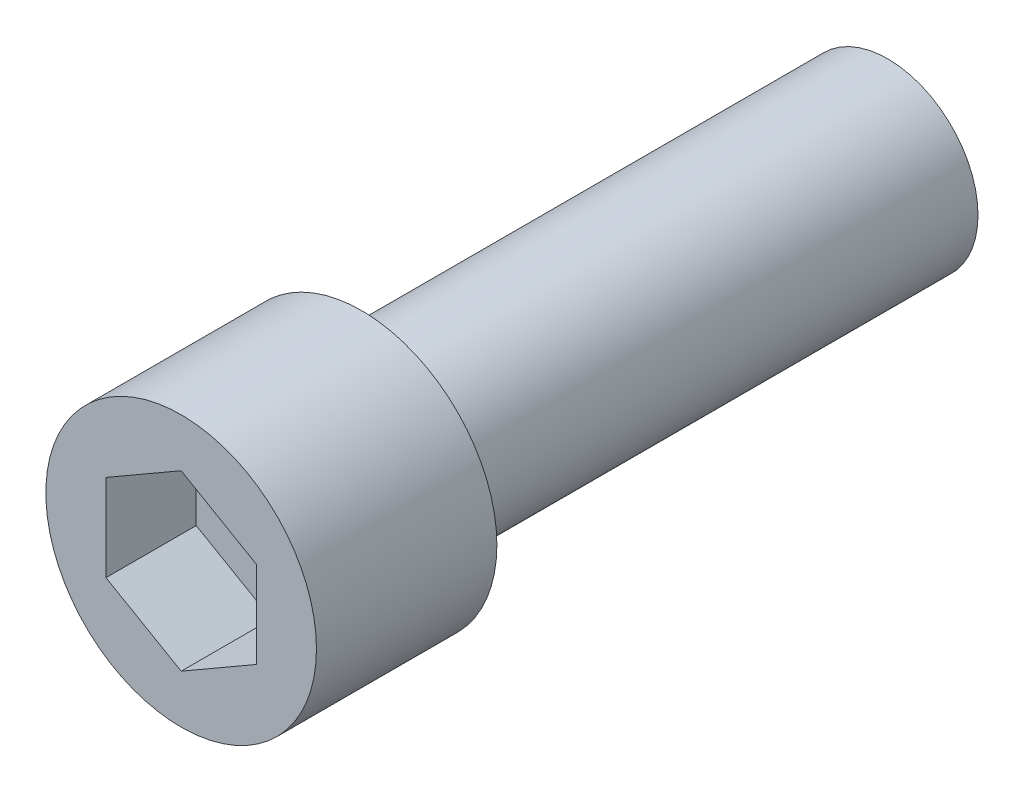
ISO-10303-21;
HEADER;
FILE_DESCRIPTION(('STEP AP214'),'2;1');
FILE_NAME('part.step','',(''),(''),'','','');
FILE_SCHEMA(('AUTOMOTIVE_DESIGN { 1 0 10303 214 1 1 1 1 }'));
ENDSEC;
DATA;
#1=APPLICATION_CONTEXT('core data for automotive mechanical design processes');
#2=APPLICATION_PROTOCOL_DEFINITION('international standard','automotive_design',2000,#1);
#3=PRODUCT_CONTEXT('',#1,'mechanical');
#4=PRODUCT('Part','Part','',(#3));
#5=PRODUCT_RELATED_PRODUCT_CATEGORY('part','',(#4));
#6=PRODUCT_DEFINITION_FORMATION('','',#4);
#7=PRODUCT_DEFINITION_CONTEXT('part definition',#1,'design');
#8=PRODUCT_DEFINITION('design','',#6,#7);
#9=PRODUCT_DEFINITION_SHAPE('','',#8);
#10=(LENGTH_UNIT() NAMED_UNIT(*) SI_UNIT(.MILLI.,.METRE.));
#11=(NAMED_UNIT(*) PLANE_ANGLE_UNIT() SI_UNIT($,.RADIAN.));
#12=(NAMED_UNIT(*) SI_UNIT($,.STERADIAN.) SOLID_ANGLE_UNIT());
#13=UNCERTAINTY_MEASURE_WITH_UNIT(LENGTH_MEASURE(1.E-05),#10,'distance_accuracy_value','');
#14=(GEOMETRIC_REPRESENTATION_CONTEXT(3) GLOBAL_UNCERTAINTY_ASSIGNED_CONTEXT((#13)) GLOBAL_UNIT_ASSIGNED_CONTEXT((#10,
#11,#12)) REPRESENTATION_CONTEXT('',''));
#15=CARTESIAN_POINT('',(0.,0.,0.));
#16=DIRECTION('',(0.,0.,1.));
#17=DIRECTION('',(1.,0.,0.));
#18=AXIS2_PLACEMENT_3D('',#15,#16,#17);
#19=CARTESIAN_POINT('',(0.,0.,50.));
#20=DIRECTION('',(0.,0.,1.));
#21=DIRECTION('',(1.,0.,0.));
#22=AXIS2_PLACEMENT_3D('',#19,#20,#21);
#23=CYLINDRICAL_SURFACE('',#22,6.);
#24=CARTESIAN_POINT('',(0.,0.,0.));
#25=DIRECTION('',(0.,0.,1.));
#26=DIRECTION('',(1.,0.,0.));
#27=AXIS2_PLACEMENT_3D('',#24,#25,#26);
#28=CIRCLE('',#27,6.);
#29=CARTESIAN_POINT('',(6.,0.,0.));
#30=VERTEX_POINT('',#29);
#31=EDGE_CURVE('E116',#30,#30,#28,.T.);
#32=ORIENTED_EDGE('',*,*,#31,.F.);
#33=EDGE_LOOP('',(#32));
#34=FACE_BOUND('',#33,.T.);
#35=CARTESIAN_POINT('',(0.,0.,-35.));
#36=DIRECTION('',(0.,0.,1.));
#37=DIRECTION('',(1.,0.,0.));
#38=AXIS2_PLACEMENT_3D('',#35,#36,#37);
#39=CIRCLE('',#38,6.);
#40=CARTESIAN_POINT('',(6.,0.,-35.));
#41=VERTEX_POINT('',#40);
#42=EDGE_CURVE('E9',#41,#41,#39,.T.);
#43=ORIENTED_EDGE('',*,*,#42,.T.);
#44=EDGE_LOOP('',(#43));
#45=FACE_BOUND('',#44,.T.);
#46=ADVANCED_FACE('F14',(#34,#45),#23,.T.);
#47=CARTESIAN_POINT('',(0.,0.,-35.));
#48=DIRECTION('',(0.,0.,1.));
#49=DIRECTION('',(1.,0.,0.));
#50=AXIS2_PLACEMENT_3D('',#47,#48,#49);
#51=PLANE('',#50);
#52=ORIENTED_EDGE('',*,*,#42,.F.);
#53=EDGE_LOOP('',(#52));
#54=FACE_BOUND('',#53,.T.);
#55=ADVANCED_FACE('F145',(#54),#51,.F.);
#56=CARTESIAN_POINT('',(9.,0.,12.));
#57=DIRECTION('',(0.,0.,-1.));
#58=DIRECTION('',(-1.,0.,0.));
#59=AXIS2_PLACEMENT_3D('',#56,#57,#58);
#60=PLANE('',#59);
#61=DIRECTION('',(0.,1.,0.));
#62=VECTOR('',#61,1.);
#63=CARTESIAN_POINT('',(5.,-2.88675134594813,12.));
#64=LINE('',#63,#62);
#65=CARTESIAN_POINT('',(5.,-2.88675134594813,12.));
#66=VERTEX_POINT('',#65);
#67=CARTESIAN_POINT('',(5.,2.88675134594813,12.));
#68=VERTEX_POINT('',#67);
#69=EDGE_CURVE('E82',#66,#68,#64,.T.);
#70=ORIENTED_EDGE('',*,*,#69,.F.);
#71=DIRECTION('',(0.866025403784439,0.5,0.));
#72=VECTOR('',#71,1.);
#73=CARTESIAN_POINT('',(0.,-5.77350269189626,12.));
#74=LINE('',#73,#72);
#75=CARTESIAN_POINT('',(0.,-5.77350269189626,12.));
#76=VERTEX_POINT('',#75);
#77=EDGE_CURVE('E28',#76,#66,#74,.T.);
#78=ORIENTED_EDGE('',*,*,#77,.F.);
#79=DIRECTION('',(0.866025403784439,-0.5,0.));
#80=VECTOR('',#79,1.);
#81=CARTESIAN_POINT('',(-5.,-2.88675134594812,12.));
#82=LINE('',#81,#80);
#83=CARTESIAN_POINT('',(-5.,-2.88675134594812,12.));
#84=VERTEX_POINT('',#83);
#85=EDGE_CURVE('E98',#84,#76,#82,.T.);
#86=ORIENTED_EDGE('',*,*,#85,.F.);
#87=DIRECTION('',(0.,-1.,0.));
#88=VECTOR('',#87,1.);
#89=CARTESIAN_POINT('',(-5.,2.88675134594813,12.));
#90=LINE('',#89,#88);
#91=CARTESIAN_POINT('',(-5.,2.88675134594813,12.));
#92=VERTEX_POINT('',#91);
#93=EDGE_CURVE('E92',#92,#84,#90,.T.);
#94=ORIENTED_EDGE('',*,*,#93,.F.);
#95=DIRECTION('',(-0.866025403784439,-0.5,0.));
#96=VECTOR('',#95,1.);
#97=CARTESIAN_POINT('',(0.,5.77350269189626,12.));
#98=LINE('',#97,#96);
#99=CARTESIAN_POINT('',(0.,5.77350269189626,12.));
#100=VERTEX_POINT('',#99);
#101=EDGE_CURVE('E90',#100,#92,#98,.T.);
#102=ORIENTED_EDGE('',*,*,#101,.F.);
#103=DIRECTION('',(-0.866025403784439,0.5,0.));
#104=VECTOR('',#103,1.);
#105=CARTESIAN_POINT('',(5.,2.88675134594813,12.));
#106=LINE('',#105,#104);
#107=EDGE_CURVE('E71',#68,#100,#106,.T.);
#108=ORIENTED_EDGE('',*,*,#107,.F.);
#109=EDGE_LOOP('',(#70,#78,#86,#94,#102,#108));
#110=FACE_BOUND('',#109,.T.);
#111=CARTESIAN_POINT('',(0.,0.,12.));
#112=DIRECTION('',(0.,0.,1.));
#113=DIRECTION('',(1.,0.,0.));
#114=AXIS2_PLACEMENT_3D('',#111,#112,#113);
#115=CIRCLE('',#114,9.);
#116=CARTESIAN_POINT('',(9.,0.,12.));
#117=VERTEX_POINT('',#116);
#118=EDGE_CURVE('E21',#117,#117,#115,.T.);
#119=ORIENTED_EDGE('',*,*,#118,.T.);
#120=EDGE_LOOP('',(#119));
#121=FACE_BOUND('',#120,.T.);
#122=ADVANCED_FACE('F86',(#110,#121),#60,.F.);
#123=CARTESIAN_POINT('',(0.,0.,50.));
#124=DIRECTION('',(0.,0.,1.));
#125=DIRECTION('',(1.,0.,0.));
#126=AXIS2_PLACEMENT_3D('',#123,#124,#125);
#127=CYLINDRICAL_SURFACE('',#126,9.);
#128=ORIENTED_EDGE('',*,*,#118,.F.);
#129=EDGE_LOOP('',(#128));
#130=FACE_BOUND('',#129,.T.);
#131=CARTESIAN_POINT('',(0.,0.,0.));
#132=DIRECTION('',(0.,0.,1.));
#133=DIRECTION('',(1.,0.,0.));
#134=AXIS2_PLACEMENT_3D('',#131,#132,#133);
#135=CIRCLE('',#134,9.);
#136=CARTESIAN_POINT('',(9.,0.,0.));
#137=VERTEX_POINT('',#136);
#138=EDGE_CURVE('E125',#137,#137,#135,.T.);
#139=ORIENTED_EDGE('',*,*,#138,.T.);
#140=EDGE_LOOP('',(#139));
#141=FACE_BOUND('',#140,.T.);
#142=ADVANCED_FACE('F130',(#130,#141),#127,.T.);
#143=CARTESIAN_POINT('',(6.,0.,0.));
#144=DIRECTION('',(0.,0.,1.));
#145=DIRECTION('',(1.,0.,0.));
#146=AXIS2_PLACEMENT_3D('',#143,#144,#145);
#147=PLANE('',#146);
#148=ORIENTED_EDGE('',*,*,#138,.F.);
#149=EDGE_LOOP('',(#148));
#150=FACE_BOUND('',#149,.T.);
#151=ORIENTED_EDGE('',*,*,#31,.T.);
#152=EDGE_LOOP('',(#151));
#153=FACE_BOUND('',#152,.T.);
#154=ADVANCED_FACE('F133',(#150,#153),#147,.F.);
#155=CARTESIAN_POINT('',(0.,-5.77350269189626,6.));
#156=DIRECTION('',(0.5,-0.866025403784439,0.));
#157=DIRECTION('',(0.866025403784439,0.5,0.));
#158=AXIS2_PLACEMENT_3D('',#155,#156,#157);
#159=PLANE('',#158);
#160=ORIENTED_EDGE('',*,*,#77,.T.);
#161=DIRECTION('',(0.,0.,1.));
#162=VECTOR('',#161,1.);
#163=CARTESIAN_POINT('',(5.,-2.88675134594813,6.));
#164=LINE('',#163,#162);
#165=CARTESIAN_POINT('',(5.,-2.88675134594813,6.));
#166=VERTEX_POINT('',#165);
#167=EDGE_CURVE('E79',#166,#66,#164,.T.);
#168=ORIENTED_EDGE('',*,*,#167,.F.);
#169=DIRECTION('',(0.866025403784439,0.5,0.));
#170=VECTOR('',#169,1.);
#171=CARTESIAN_POINT('',(0.,-5.77350269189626,6.));
#172=LINE('',#171,#170);
#173=CARTESIAN_POINT('',(0.,-5.77350269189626,6.));
#174=VERTEX_POINT('',#173);
#175=EDGE_CURVE('E100',#174,#166,#172,.T.);
#176=ORIENTED_EDGE('',*,*,#175,.F.);
#177=DIRECTION('',(0.,0.,1.));
#178=VECTOR('',#177,1.);
#179=CARTESIAN_POINT('',(0.,-5.77350269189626,6.));
#180=LINE('',#179,#178);
#181=EDGE_CURVE('E35',#174,#76,#180,.T.);
#182=ORIENTED_EDGE('',*,*,#181,.T.);
#183=EDGE_LOOP('',(#160,#168,#176,#182));
#184=FACE_BOUND('',#183,.T.);
#185=ADVANCED_FACE('F139',(#184),#159,.F.);
#186=CARTESIAN_POINT('',(-5.,-2.88675134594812,6.));
#187=DIRECTION('',(-0.5,-0.866025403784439,0.));
#188=DIRECTION('',(0.866025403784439,-0.5,0.));
#189=AXIS2_PLACEMENT_3D('',#186,#187,#188);
#190=PLANE('',#189);
#191=ORIENTED_EDGE('',*,*,#85,.T.);
#192=ORIENTED_EDGE('',*,*,#181,.F.);
#193=DIRECTION('',(0.866025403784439,-0.5,0.));
#194=VECTOR('',#193,1.);
#195=CARTESIAN_POINT('',(-5.,-2.88675134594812,6.));
#196=LINE('',#195,#194);
#197=CARTESIAN_POINT('',(-5.,-2.88675134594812,6.));
#198=VERTEX_POINT('',#197);
#199=EDGE_CURVE('E112',#198,#174,#196,.T.);
#200=ORIENTED_EDGE('',*,*,#199,.F.);
#201=DIRECTION('',(0.,0.,1.));
#202=VECTOR('',#201,1.);
#203=CARTESIAN_POINT('',(-5.,-2.88675134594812,6.));
#204=LINE('',#203,#202);
#205=EDGE_CURVE('E117',#198,#84,#204,.T.);
#206=ORIENTED_EDGE('',*,*,#205,.T.);
#207=EDGE_LOOP('',(#191,#192,#200,#206));
#208=FACE_BOUND('',#207,.T.);
#209=ADVANCED_FACE('F158',(#208),#190,.F.);
#210=CARTESIAN_POINT('',(-5.,2.88675134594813,6.));
#211=DIRECTION('',(-1.,0.,0.));
#212=DIRECTION('',(0.,-1.,0.));
#213=AXIS2_PLACEMENT_3D('',#210,#211,#212);
#214=PLANE('',#213);
#215=ORIENTED_EDGE('',*,*,#93,.T.);
#216=ORIENTED_EDGE('',*,*,#205,.F.);
#217=DIRECTION('',(0.,-1.,0.));
#218=VECTOR('',#217,1.);
#219=CARTESIAN_POINT('',(-5.,2.88675134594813,6.));
#220=LINE('',#219,#218);
#221=CARTESIAN_POINT('',(-5.,2.88675134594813,6.));
#222=VERTEX_POINT('',#221);
#223=EDGE_CURVE('E109',#222,#198,#220,.T.);
#224=ORIENTED_EDGE('',*,*,#223,.F.);
#225=DIRECTION('',(0.,0.,1.));
#226=VECTOR('',#225,1.);
#227=CARTESIAN_POINT('',(-5.,2.88675134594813,6.));
#228=LINE('',#227,#226);
#229=EDGE_CURVE('E119',#222,#92,#228,.T.);
#230=ORIENTED_EDGE('',*,*,#229,.T.);
#231=EDGE_LOOP('',(#215,#216,#224,#230));
#232=FACE_BOUND('',#231,.T.);
#233=ADVANCED_FACE('F167',(#232),#214,.F.);
#234=CARTESIAN_POINT('',(0.,5.77350269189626,6.));
#235=DIRECTION('',(-0.5,0.866025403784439,0.));
#236=DIRECTION('',(-0.866025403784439,-0.5,0.));
#237=AXIS2_PLACEMENT_3D('',#234,#235,#236);
#238=PLANE('',#237);
#239=ORIENTED_EDGE('',*,*,#101,.T.);
#240=ORIENTED_EDGE('',*,*,#229,.F.);
#241=DIRECTION('',(-0.866025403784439,-0.5,0.));
#242=VECTOR('',#241,1.);
#243=CARTESIAN_POINT('',(0.,5.77350269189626,6.));
#244=LINE('',#243,#242);
#245=CARTESIAN_POINT('',(0.,5.77350269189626,6.));
#246=VERTEX_POINT('',#245);
#247=EDGE_CURVE('E106',#246,#222,#244,.T.);
#248=ORIENTED_EDGE('',*,*,#247,.F.);
#249=DIRECTION('',(0.,0.,1.));
#250=VECTOR('',#249,1.);
#251=CARTESIAN_POINT('',(0.,5.77350269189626,6.));
#252=LINE('',#251,#250);
#253=EDGE_CURVE('E78',#246,#100,#252,.T.);
#254=ORIENTED_EDGE('',*,*,#253,.T.);
#255=EDGE_LOOP('',(#239,#240,#248,#254));
#256=FACE_BOUND('',#255,.T.);
#257=ADVANCED_FACE('F164',(#256),#238,.F.);
#258=CARTESIAN_POINT('',(5.,2.88675134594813,6.));
#259=DIRECTION('',(0.5,0.866025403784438,0.));
#260=DIRECTION('',(-0.866025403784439,0.5,0.));
#261=AXIS2_PLACEMENT_3D('',#258,#259,#260);
#262=PLANE('',#261);
#263=ORIENTED_EDGE('',*,*,#107,.T.);
#264=ORIENTED_EDGE('',*,*,#253,.F.);
#265=DIRECTION('',(-0.866025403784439,0.5,0.));
#266=VECTOR('',#265,1.);
#267=CARTESIAN_POINT('',(5.,2.88675134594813,6.));
#268=LINE('',#267,#266);
#269=CARTESIAN_POINT('',(5.,2.88675134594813,6.));
#270=VERTEX_POINT('',#269);
#271=EDGE_CURVE('E74',#270,#246,#268,.T.);
#272=ORIENTED_EDGE('',*,*,#271,.F.);
#273=DIRECTION('',(0.,0.,1.));
#274=VECTOR('',#273,1.);
#275=CARTESIAN_POINT('',(5.,2.88675134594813,6.));
#276=LINE('',#275,#274);
#277=EDGE_CURVE('E67',#270,#68,#276,.T.);
#278=ORIENTED_EDGE('',*,*,#277,.T.);
#279=EDGE_LOOP('',(#263,#264,#272,#278));
#280=FACE_BOUND('',#279,.T.);
#281=ADVANCED_FACE('F69',(#280),#262,.F.);
#282=CARTESIAN_POINT('',(5.,-2.88675134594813,6.));
#283=DIRECTION('',(1.,0.,0.));
#284=DIRECTION('',(0.,1.,0.));
#285=AXIS2_PLACEMENT_3D('',#282,#283,#284);
#286=PLANE('',#285);
#287=ORIENTED_EDGE('',*,*,#69,.T.);
#288=ORIENTED_EDGE('',*,*,#277,.F.);
#289=DIRECTION('',(0.,1.,0.));
#290=VECTOR('',#289,1.);
#291=CARTESIAN_POINT('',(5.,-2.88675134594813,6.));
#292=LINE('',#291,#290);
#293=EDGE_CURVE('E103',#166,#270,#292,.T.);
#294=ORIENTED_EDGE('',*,*,#293,.F.);
#295=ORIENTED_EDGE('',*,*,#167,.T.);
#296=EDGE_LOOP('',(#287,#288,#294,#295));
#297=FACE_BOUND('',#296,.T.);
#298=ADVANCED_FACE('F83',(#297),#286,.F.);
#299=CARTESIAN_POINT('',(10.,0.,6.));
#300=DIRECTION('',(0.,0.,1.));
#301=DIRECTION('',(1.,0.,0.));
#302=AXIS2_PLACEMENT_3D('',#299,#300,#301);
#303=PLANE('',#302);
#304=ORIENTED_EDGE('',*,*,#175,.T.);
#305=ORIENTED_EDGE('',*,*,#293,.T.);
#306=ORIENTED_EDGE('',*,*,#271,.T.);
#307=ORIENTED_EDGE('',*,*,#247,.T.);
#308=ORIENTED_EDGE('',*,*,#223,.T.);
#309=ORIENTED_EDGE('',*,*,#199,.T.);
#310=EDGE_LOOP('',(#304,#305,#306,#307,#308,#309));
#311=FACE_BOUND('',#310,.T.);
#312=ADVANCED_FACE('F161',(#311),#303,.T.);
#313=CLOSED_SHELL('',(#46,#55,#122,#142,#154,#185,#209,#233,#257,#281,#298,#312));
#314=MANIFOLD_SOLID_BREP('B1',#313);
#315=ADVANCED_BREP_SHAPE_REPRESENTATION('',(#18,#314),#14);
#316=SHAPE_DEFINITION_REPRESENTATION(#9,#315);
ENDSEC;
END-ISO-10303-21;
